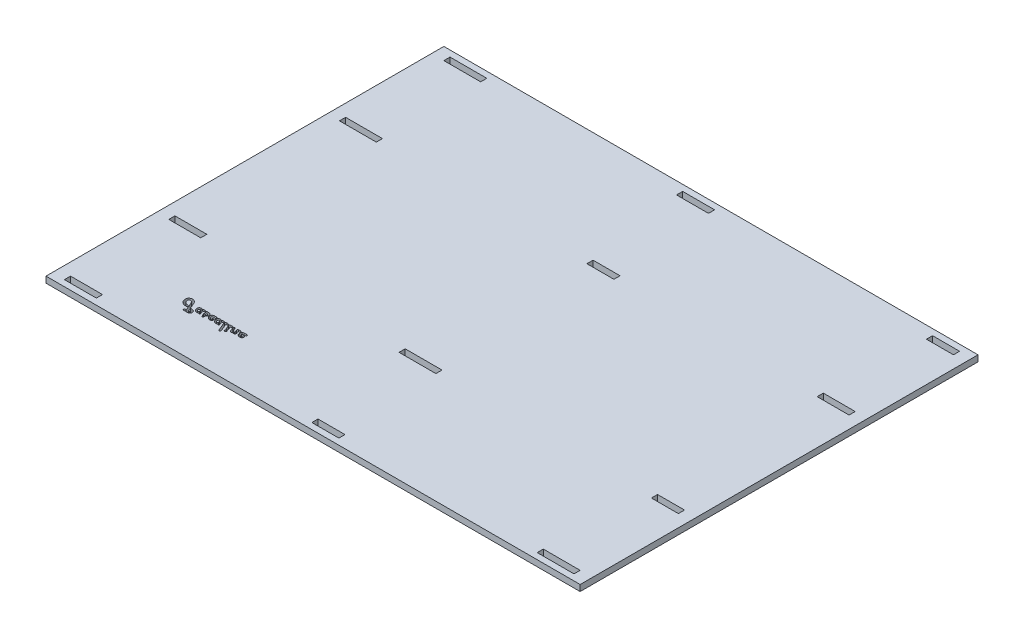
from build123d import *

# Parameters (mm, degrees)
SKETCH1_W           = 276.225
SKETCH1_H           = 205.74
SKETCH1_W_2         = 19.05
SKETCH1_H_2         = 3.175
SKETCH1_W_3         = 16.51
SKETCH1_W_4         = 13.97
BOSS_EXTRUDE1_DEPTH = 3.175
CUT_EXTRUDE1_DEPTH  = 345.440530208


with BuildPart() as part:
    # Sketch1 → Boss-Extrude1 (new body)
    with BuildSketch(Plane(origin=(0, 0, 0), x_dir=(1, 0, 0), z_dir=(0, 1, 0))):
        with Locations((138.1125, -102.87)):
            Rectangle(SKETCH1_W, SKETCH1_H)
        with Locations((15.875, -58.7375)):
            Rectangle(SKETCH1_W_2, SKETCH1_H_2, mode=Mode.SUBTRACT)
        with Locations((15.875, -4.7625)):
            Rectangle(SKETCH1_W_2, SKETCH1_H_2, mode=Mode.SUBTRACT)
        with Locations((134.9375, -4.7625)):
            Rectangle(SKETCH1_W_3, SKETCH1_H_2, mode=Mode.SUBTRACT)
        with Locations((262.89, -4.7625)):
            Rectangle(SKETCH1_W_4, SKETCH1_H_2, mode=Mode.SUBTRACT)
        with Locations((141.2875, -58.7375)):
            Rectangle(SKETCH1_W_4, SKETCH1_H_2, mode=Mode.SUBTRACT)
        with Locations((261.62, -58.7375)):
            Rectangle(SKETCH1_W_3, SKETCH1_H_2, mode=Mode.SUBTRACT)
        with Locations((14.605, -147.0025)):
            Rectangle(SKETCH1_W_3, SKETCH1_H_2, mode=Mode.SUBTRACT)
        with Locations((134.9375, -147.0025)):
            Rectangle(SKETCH1_W_2, SKETCH1_H_2, mode=Mode.SUBTRACT)
        with Locations((262.89, -147.0025)):
            Rectangle(SKETCH1_W_4, SKETCH1_H_2, mode=Mode.SUBTRACT)
        with Locations((14.605, -200.9775)):
            Rectangle(SKETCH1_W_3, SKETCH1_H_2, mode=Mode.SUBTRACT)
        with Locations((141.2875, -200.9775)):
            Rectangle(SKETCH1_W_4, SKETCH1_H_2, mode=Mode.SUBTRACT)
        with Locations((260.35, -200.9775)):
            Rectangle(SKETCH1_W_2, SKETCH1_H_2, mode=Mode.SUBTRACT)
    extrude(amount=BOSS_EXTRUDE1_DEPTH)

    # Sketch2 → Cut-Extrude1 (cut, through all)
    # profile 1 of 10: a face of its own
    with BuildSketch(Plane.XZ):
        with BuildLine():
            Line((51.708207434, 182.79452047), (51.040213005, 181.130477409))
            add(Edge.make_bspline(
                [(51.040213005, 181.130477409), (51.00001032, 181.031340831), (50.922835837, 180.841034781), (50.80844228, 180.568553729), (50.701686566, 180.320023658), (50.60179297, 180.095385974), (50.509724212, 179.893979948), (50.422539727, 179.717428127), (50.344969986, 179.563780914), (50.250360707, 179.39266641), (50.128120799, 179.202342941), (49.964033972, 178.99474829), (49.783466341, 178.802663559), (49.649135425, 178.689800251), (49.581798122, 178.633224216)],
                knots=[0, 0, 0, 0, 1.315970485, 2.526183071, 3.635244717, 4.643279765, 5.550454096, 6.359128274, 7.065363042, 7.667512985, 8.763908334, 9.843272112, 10.918877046, 12, 12, 12, 12], degree=3))
            add(Edge.make_bspline(
                [(49.581798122, 178.633224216), (49.530872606, 178.595142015), (49.430077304, 178.519767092), (49.269407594, 178.421962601), (49.103570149, 178.338383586), (48.930580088, 178.271585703), (48.752011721, 178.219327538), (48.567251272, 178.181172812), (48.376360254, 178.157947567), (48.24706303, 178.155470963), (48.181624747, 178.154217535)],
                knots=[0, 0, 0, 0, 1.011044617, 2.001129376, 2.987597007, 3.961339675, 4.946518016, 5.943976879, 6.959431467, 8, 8, 8, 8], degree=3))
            add(Edge.make_bspline(
                [(48.181624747, 178.154217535), (48.112991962, 178.155689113), (47.978819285, 178.158565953), (47.782876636, 178.18476624), (47.596129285, 178.223973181), (47.419787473, 178.283249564), (47.252340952, 178.356418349), (47.095607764, 178.447809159), (46.948674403, 178.554992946), (46.813814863, 178.678725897), (46.691575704, 178.814608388), (46.585375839, 178.961956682), (46.494000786, 179.118377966), (46.420454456, 179.285592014), (46.363061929, 179.462414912), (46.323373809, 179.648876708), (46.297313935, 179.84486499), (46.294417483, 179.979031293), (46.292935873, 180.047660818)],
                knots=[0, 0, 0, 0, 1.095039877, 2.140732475, 3.150521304, 4.13652018, 5.104897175, 6.062745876, 7.026672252, 8.00261995, 8.979018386, 9.939223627, 10.897072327, 11.865449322, 12.849478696, 13.859267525, 14.904960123, 16, 16, 16, 16], degree=3))
            add(Edge.make_bspline(
                [(46.292935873, 180.047660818), (46.295476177, 180.140106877), (46.300491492, 180.322622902), (46.339577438, 180.591864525), (46.403678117, 180.852395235), (46.494678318, 181.103879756), (46.610304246, 181.346741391), (46.753317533, 181.579480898), (46.921048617, 181.804170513), (47.049937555, 181.943030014), (47.115448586, 182.013608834)],
                knots=[0, 0, 0, 0, 1.01377589, 2.001495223, 2.977585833, 3.952291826, 4.930103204, 5.92294397, 6.944284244, 8, 8, 8, 8], degree=3))
            add(Edge.make_bspline(
                [(47.115448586, 182.013608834), (47.153044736, 182.050924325), (47.228930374, 182.126243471), (47.351390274, 182.231124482), (47.480395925, 182.331316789), (47.615349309, 182.426878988), (47.758843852, 182.513996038), (47.907546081, 182.598384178), (48.064614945, 182.674541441), (48.279714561, 182.771179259), (48.554431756, 182.870917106), (48.886845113, 182.958589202), (49.218755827, 183.011704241), (49.439773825, 183.019068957), (49.549705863, 183.02273209)],
                knots=[0, 0, 0, 0, 0.706155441, 1.425333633, 2.148189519, 2.883981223, 3.628821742, 4.385725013, 5.163077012, 5.955384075, 7.529784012, 9.053423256, 10.534403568, 12, 12, 12, 12], degree=3))
            add(Edge.make_bspline(
                [(49.549705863, 183.02273209), (49.59978406, 183.021540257), (49.695623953, 183.019259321), (49.831291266, 182.990920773), (49.952441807, 182.947665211), (50.056344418, 182.885588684), (50.141795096, 182.809995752), (50.205094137, 182.721046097), (50.242232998, 182.618989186), (50.246446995, 182.547193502), (50.248603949, 182.510444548)],
                knots=[0, 0, 0, 0, 1.238826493, 2.370872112, 3.417595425, 4.41258701, 5.350953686, 6.225146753, 7.091533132, 8, 8, 8, 8], degree=3))
            add(Edge.make_bspline(
                [(50.248603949, 182.510444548), (50.246165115, 182.47167473), (50.241410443, 182.396090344), (50.201524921, 182.288702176), (50.134061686, 182.194477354), (50.073237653, 182.145768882), (50.041787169, 182.120583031)],
                knots=[0, 0, 0, 0, 1.010937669, 1.970891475, 2.950802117, 4, 4, 4, 4], degree=3))
            add(Edge.make_bspline(
                [(50.041787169, 182.120583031), (50.017656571, 182.10617239), (49.963309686, 182.073716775), (49.860178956, 182.042998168), (49.731734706, 182.017208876), (49.636221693, 182.007184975), (49.584175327, 182.001722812)],
                knots=[0, 0, 0, 0, 0.704559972, 1.586808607, 2.68501851, 4, 4, 4, 4], degree=3))
            add(Edge.make_bspline(
                [(49.584175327, 182.001722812), (49.519905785, 181.995250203), (49.394570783, 181.982627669), (49.211967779, 181.953054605), (49.038200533, 181.919845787), (48.874225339, 181.876482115), (48.719190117, 181.827579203), (48.572698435, 181.774036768), (48.436580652, 181.710400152), (48.350934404, 181.662675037), (48.308805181, 181.639199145)],
                knots=[0, 0, 0, 0, 1.159710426, 2.261604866, 3.320677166, 4.335395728, 5.305245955, 6.239579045, 7.134052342, 8, 8, 8, 8], degree=3))
            add(Edge.make_bspline(
                [(48.308805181, 181.639199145), (48.243425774, 181.597250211), (48.114631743, 181.514612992), (47.943432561, 181.363133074), (47.79233938, 181.19487476), (47.664635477, 181.00902045), (47.562633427, 180.811182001), (47.487797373, 180.606164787), (47.441933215, 180.395180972), (47.43664309, 180.252322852), (47.433993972, 180.180784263)],
                knots=[0, 0, 0, 0, 1.047576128, 2.063670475, 3.075290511, 4.094745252, 5.099666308, 6.072755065, 7.034899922, 8, 8, 8, 8], degree=3))
            add(Edge.make_bspline(
                [(47.433993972, 180.180784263), (47.43464278, 180.145096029), (47.435914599, 180.075138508), (47.446906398, 179.973043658), (47.4640252, 179.87615749), (47.490795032, 179.785799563), (47.522869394, 179.700545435), (47.561701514, 179.620297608), (47.609924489, 179.546997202), (47.662983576, 179.478348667), (47.724139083, 179.418352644), (47.788911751, 179.364063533), (47.860332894, 179.320265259), (47.93554979, 179.282611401), (48.016358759, 179.25449148), (48.102029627, 179.234450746), (48.192262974, 179.220494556), (48.254470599, 179.219640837), (48.286221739, 179.219205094)],
                knots=[0, 0, 0, 0, 1.180906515, 2.314860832, 3.395146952, 4.432720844, 5.428859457, 6.408284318, 7.375873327, 8.328235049, 9.274073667, 10.205991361, 11.119268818, 12.040047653, 12.985704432, 13.943108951, 14.9501506, 16, 16, 16, 16], degree=3))
            add(Edge.make_bspline(
                [(48.286221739, 179.219205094), (48.326733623, 179.220089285), (48.406702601, 179.221834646), (48.523743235, 179.243468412), (48.636751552, 179.275266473), (48.745544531, 179.321036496), (48.85049787, 179.379435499), (48.950857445, 179.451340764), (49.046238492, 179.536749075), (49.139137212, 179.635601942), (49.229520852, 179.752163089), (49.324297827, 179.885231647), (49.418346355, 180.040578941), (49.515503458, 180.215206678), (49.615293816, 180.409494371), (49.717880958, 180.623606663), (49.820193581, 180.859081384), (49.888666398, 181.023020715), (49.924115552, 181.107893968)],
                knots=[0, 0, 0, 0, 0.731682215, 1.444313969, 2.14503258, 2.851587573, 3.573238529, 4.31284086, 5.079201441, 5.885132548, 6.76239785, 7.744387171, 8.838039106, 10.04403949, 11.357848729, 12.787140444, 14.336666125, 16, 16, 16, 16], degree=3))
            Line((49.924115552, 181.107893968), (51.319534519, 184.544142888))
            Line((51.319534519, 184.544142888), (50.882128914, 184.544142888))
            add(Edge.make_bspline(
                [(50.882128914, 184.544142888), (50.838488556, 184.54522865), (50.756791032, 184.547261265), (50.642475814, 184.563396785), (50.544918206, 184.590948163), (50.464559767, 184.631358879), (50.401089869, 184.683751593), (50.355558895, 184.748821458), (50.32861426, 184.826228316), (50.326022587, 184.881488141), (50.324674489, 184.910232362)],
                knots=[0, 0, 0, 0, 1.386647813, 2.595892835, 3.659749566, 4.594681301, 5.434731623, 6.248703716, 7.089037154, 8, 8, 8, 8], degree=3))
            add(Edge.make_bspline(
                [(50.324674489, 184.910232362), (50.326610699, 184.951372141), (50.330345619, 185.030730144), (50.369106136, 185.142032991), (50.430929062, 185.23923404), (50.519700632, 185.318386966), (50.629358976, 185.381488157), (50.759608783, 185.426231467), (50.909273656, 185.451690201), (51.015149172, 185.455156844), (51.071116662, 185.456989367)],
                knots=[0, 0, 0, 0, 0.942601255, 1.818263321, 2.674766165, 3.564433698, 4.523656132, 5.566505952, 6.713616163, 8, 8, 8, 8], degree=3))
            Line((51.071116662, 185.456989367), (52.598470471, 185.456989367))
            add(Edge.make_bspline(
                [(52.598470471, 185.456989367), (52.661491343, 185.45605179), (52.783711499, 185.454233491), (52.960666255, 185.440997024), (53.125164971, 185.420336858), (53.276667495, 185.389726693), (53.415010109, 185.349404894), (53.540711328, 185.300515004), (53.65455597, 185.244026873), (53.755463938, 185.176779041), (53.843887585, 185.100669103), (53.920324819, 185.014744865), (53.983980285, 184.919078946), (54.038875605, 184.814945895), (54.07866019, 184.699753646), (54.106672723, 184.575328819), (54.12514973, 184.441676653), (54.127163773, 184.349276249), (54.128201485, 184.301668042)],
                knots=[0, 0, 0, 0, 1.377685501, 2.671828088, 3.877302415, 5.000186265, 6.047243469, 7.023626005, 7.94558449, 8.820055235, 9.667510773, 10.489711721, 11.325757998, 12.174186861, 13.056345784, 13.980864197, 14.959664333, 16, 16, 16, 16], degree=3))
            add(Edge.make_bspline(
                [(54.128201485, 184.301668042), (54.126224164, 184.24294268), (54.122343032, 184.127675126), (54.09622563, 183.958719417), (54.050564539, 183.798497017), (53.987547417, 183.64601214), (53.904433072, 183.503066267), (53.804741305, 183.367351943), (53.687249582, 183.239446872), (53.596640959, 183.164349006), (53.550540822, 183.12614048)],
                knots=[0, 0, 0, 0, 1.037190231, 2.03582197, 3.010506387, 3.973515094, 4.942177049, 5.923321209, 6.943420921, 8, 8, 8, 8], degree=3))
            add(Edge.make_bspline(
                [(53.550540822, 183.12614048), (53.513867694, 183.099501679), (53.438573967, 183.044809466), (53.311285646, 182.977706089), (53.170301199, 182.920538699), (53.014829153, 182.874856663), (52.846058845, 182.838032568), (52.662920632, 182.812269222), (52.465619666, 182.796761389), (52.329083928, 182.795283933), (52.258530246, 182.79452047)],
                knots=[0, 0, 0, 0, 0.800437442, 1.643380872, 2.535600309, 3.486195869, 4.50417187, 5.586788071, 6.752993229, 8, 8, 8, 8], degree=3))
            Line((52.258530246, 182.79452047), (51.708207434, 182.79452047))
        make_face()
        with BuildLine():
            Line((52.098068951, 183.707366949), (52.422557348, 183.707366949))
            add(Edge.make_bspline(
                [(52.422557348, 183.707366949), (52.47258784, 183.708782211), (52.5670161, 183.711453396), (52.698819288, 183.735741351), (52.811272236, 183.777278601), (52.904227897, 183.83600151), (52.977428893, 183.91333287), (53.026980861, 184.00899527), (53.059364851, 184.119724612), (53.061886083, 184.199195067), (53.063213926, 184.241049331)],
                knots=[0, 0, 0, 0, 1.258971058, 2.376199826, 3.358208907, 4.260347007, 5.121448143, 6.005251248, 6.949436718, 8, 8, 8, 8], degree=3))
            add(Edge.make_bspline(
                [(53.063213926, 184.241049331), (53.062073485, 184.264903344), (53.059913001, 184.310093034), (53.043862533, 184.373529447), (53.013918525, 184.426356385), (52.973772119, 184.471207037), (52.920096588, 184.503760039), (52.856537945, 184.527978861), (52.781703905, 184.541857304), (52.728086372, 184.543348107), (52.699501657, 184.544142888)],
                knots=[0, 0, 0, 0, 1.057975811, 2.004258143, 2.869579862, 3.727735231, 4.644179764, 5.623179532, 6.73286349, 8, 8, 8, 8], degree=3))
            Line((52.699501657, 184.544142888), (52.430877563, 184.544142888))
            Line((52.430877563, 184.544142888), (52.098068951, 183.707366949))
        make_face(mode=Mode.SUBTRACT)
    # profile 2 of 10: a face of its own
    with BuildSketch(Plane.XZ):
        with BuildLine():
            Line((56.179728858, 180.892756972), (56.621888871, 180.892756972))
            add(Edge.make_bspline(
                [(56.621888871, 180.892756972), (56.65877742, 180.891594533), (56.728224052, 180.889406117), (56.826106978, 180.873955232), (56.908503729, 180.843823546), (56.978460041, 180.805117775), (57.030736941, 180.750669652), (57.06864948, 180.685580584), (57.091822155, 180.608611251), (57.093872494, 180.553382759), (57.094952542, 180.524290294)],
                knots=[0, 0, 0, 0, 1.294214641, 2.436497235, 3.45633191, 4.35958604, 5.214514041, 6.067746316, 6.982155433, 8, 8, 8, 8], degree=3))
            add(Edge.make_bspline(
                [(57.094952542, 180.524290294), (57.093081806, 180.483662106), (57.089494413, 180.405751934), (57.056928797, 180.295389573), (57.000244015, 180.200597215), (56.924490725, 180.119531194), (56.828856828, 180.056616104), (56.716859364, 180.010515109), (56.588114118, 179.985437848), (56.497188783, 179.981811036), (56.449541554, 179.979910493)],
                knots=[0, 0, 0, 0, 1.02006706, 1.956119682, 2.85821293, 3.77438774, 4.72208319, 5.713685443, 6.801912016, 8, 8, 8, 8], degree=3))
            Line((56.449541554, 179.979910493), (55.93606541, 179.979910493))
            add(Edge.make_bspline(
                [(55.93606541, 179.979910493), (55.908278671, 179.980834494), (55.855146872, 179.982601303), (55.778668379, 179.995720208), (55.708938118, 180.018400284), (55.64573203, 180.050207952), (55.590092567, 180.09183418), (55.540574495, 180.140920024), (55.498327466, 180.199999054), (55.477364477, 180.244587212), (55.466567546, 180.267552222)],
                knots=[0, 0, 0, 0, 1.135602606, 2.17141737, 3.159933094, 4.123316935, 5.049777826, 5.988893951, 6.964185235, 8, 8, 8, 8], degree=3))
            add(Edge.make_bspline(
                [(55.466567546, 180.267552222), (55.418424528, 180.223702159), (55.327712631, 180.141079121), (55.178084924, 180.051827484), (55.031771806, 179.990628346), (54.932230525, 179.983401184), (54.884152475, 179.979910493)],
                knots=[0, 0, 0, 0, 1.172355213, 2.208971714, 3.134940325, 4, 4, 4, 4], degree=3))
            Line((54.884152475, 179.979910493), (54.427729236, 179.979910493))
            add(Edge.make_bspline(
                [(54.427729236, 179.979910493), (54.391619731, 179.98075717), (54.321087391, 179.982410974), (54.21802747, 179.997305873), (54.12000323, 180.02024658), (54.028140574, 180.055821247), (53.940772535, 180.098131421), (53.858897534, 180.15116498), (53.783351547, 180.214399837), (53.712720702, 180.285630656), (53.650399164, 180.365631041), (53.593831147, 180.450840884), (53.54763786, 180.543303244), (53.509384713, 180.641169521), (53.480024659, 180.744712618), (53.458019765, 180.853918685), (53.446842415, 180.969387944), (53.444675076, 181.048444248), (53.443566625, 181.088876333)],
                knots=[0, 0, 0, 0, 1.038881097, 2.029236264, 2.991883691, 3.930308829, 4.858629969, 5.782385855, 6.730121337, 7.689859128, 8.664191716, 9.644845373, 10.629272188, 11.633194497, 12.665607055, 13.723595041, 14.835769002, 16, 16, 16, 16], degree=3))
            add(Edge.make_bspline(
                [(53.443566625, 181.088876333), (53.445107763, 181.15077263), (53.448153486, 181.27309718), (53.474253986, 181.454146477), (53.515431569, 181.630157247), (53.574158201, 181.801314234), (53.649827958, 181.966769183), (53.739823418, 182.128417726), (53.849725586, 182.283187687), (53.972472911, 182.432189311), (54.106072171, 182.569321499), (54.245351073, 182.690858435), (54.390556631, 182.79213683), (54.538505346, 182.87771364), (54.692535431, 182.942119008), (54.850193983, 182.989085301), (55.01272361, 183.016977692), (55.1225611, 183.020807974), (55.177737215, 183.02273209)],
                knots=[0, 0, 0, 0, 1.038393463, 2.052158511, 3.063456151, 4.068635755, 5.08344709, 6.113632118, 7.168837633, 8.264602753, 9.350863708, 10.378663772, 11.361961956, 12.31789787, 13.241700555, 14.156967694, 15.07416527, 16, 16, 16, 16], degree=3))
            add(Edge.make_bspline(
                [(55.177737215, 183.02273209), (55.21896168, 183.021712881), (55.298853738, 183.019737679), (55.414942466, 183.007573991), (55.521853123, 182.982630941), (55.621654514, 182.953341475), (55.711262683, 182.910617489), (55.793015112, 182.860644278), (55.866700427, 182.801379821), (55.907423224, 182.753986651), (55.927745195, 182.730335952)],
                knots=[0, 0, 0, 0, 1.187749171, 2.30183041, 3.353985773, 4.346587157, 5.291117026, 6.203238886, 7.103359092, 8, 8, 8, 8], degree=3))
            add(Edge.make_bspline(
                [(55.927745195, 182.730335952), (55.944680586, 182.753711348), (55.977579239, 182.799120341), (56.033899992, 182.858946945), (56.094136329, 182.909541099), (56.15789977, 182.951846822), (56.227160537, 182.982068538), (56.298281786, 183.007094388), (56.374614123, 183.019744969), (56.426524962, 183.021720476), (56.453107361, 183.02273209)],
                knots=[0, 0, 0, 0, 1.102961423, 2.142610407, 3.131917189, 4.106850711, 5.056016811, 6.014208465, 6.983119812, 8, 8, 8, 8], degree=3))
            add(Edge.make_bspline(
                [(56.453107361, 183.02273209), (56.481339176, 183.021284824), (56.536574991, 183.018453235), (56.615795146, 182.99865781), (56.686667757, 182.962530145), (56.748918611, 182.915388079), (56.801997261, 182.859045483), (56.839082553, 182.793239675), (56.863372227, 182.721313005), (56.865598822, 182.670711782), (56.866740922, 182.644756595)],
                knots=[0, 0, 0, 0, 1.085152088, 2.123110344, 3.11068521, 4.121931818, 5.11360817, 6.061884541, 7.005870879, 8, 8, 8, 8], degree=3))
            add(Edge.make_bspline(
                [(56.866740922, 182.644756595), (56.866045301, 182.625686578), (56.864569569, 182.585230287), (56.851696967, 182.522308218), (56.831502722, 182.454251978), (56.812512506, 182.40846021), (56.802556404, 182.384452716)],
                knots=[0, 0, 0, 0, 0.847236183, 1.797378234, 2.845219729, 4, 4, 4, 4], degree=3))
            Line((56.802556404, 182.384452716), (56.758578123, 182.278667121))
            Line((56.758578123, 182.278667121), (56.179728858, 180.892756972))
        make_face()
        with BuildLine():
            Line((54.72369118, 180.892756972), (54.824722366, 180.892756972))
            add(Edge.make_bspline(
                [(54.824722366, 180.892756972), (54.850124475, 180.893313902), (54.899252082, 180.894391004), (54.969711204, 180.906223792), (55.03322592, 180.926536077), (55.090449, 180.954060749), (55.140540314, 180.989991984), (55.184311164, 181.033437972), (55.22046545, 181.085632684), (55.238538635, 181.124621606), (55.247864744, 181.144740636)],
                knots=[0, 0, 0, 0, 1.157664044, 2.238919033, 3.244614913, 4.190073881, 5.122668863, 6.042574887, 6.989931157, 8, 8, 8, 8], degree=3))
            Line((55.247864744, 181.144740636), (55.518866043, 181.796094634))
            add(Edge.make_bspline(
                [(55.518866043, 181.796094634), (55.535057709, 181.834756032), (55.563854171, 181.903514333), (55.570592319, 181.977609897), (55.573541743, 182.010043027)],
                knots=[0, 0, 0, 0, 1.124559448, 2, 2, 2, 2], degree=3))
            add(Edge.make_bspline(
                [(55.573541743, 182.010043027), (55.571926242, 182.026420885), (55.568667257, 182.059460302), (55.549280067, 182.107946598), (55.512147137, 182.149283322), (55.466474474, 182.188201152), (55.41115605, 182.221159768), (55.348788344, 182.244753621), (55.28104204, 182.2595835), (55.234077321, 182.261194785), (55.209829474, 182.262026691)],
                knots=[0, 0, 0, 0, 0.81058345, 1.635208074, 2.524363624, 3.523748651, 4.593951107, 5.683817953, 6.804157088, 8, 8, 8, 8], degree=3))
            add(Edge.make_bspline(
                [(55.209829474, 182.262026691), (55.185181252, 182.261194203), (55.13540106, 182.25951289), (55.061578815, 182.243028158), (54.988551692, 182.218040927), (54.916085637, 182.182654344), (54.844138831, 182.137487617), (54.772190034, 182.082509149), (54.702427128, 182.016225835), (54.610883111, 181.918994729), (54.512009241, 181.78794112), (54.42333729, 181.622275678), (54.367109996, 181.452594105), (54.359954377, 181.337299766), (54.356413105, 181.280241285)],
                knots=[0, 0, 0, 0, 0.627706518, 1.267732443, 1.919531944, 2.592823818, 3.31892668, 4.082778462, 4.897707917, 5.769757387, 7.487317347, 9.064628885, 10.547302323, 12, 12, 12, 12], degree=3))
            add(Edge.make_bspline(
                [(54.356413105, 181.280241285), (54.357553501, 181.250053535), (54.359718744, 181.192736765), (54.375717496, 181.1124477), (54.403996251, 181.043784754), (54.446132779, 180.988202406), (54.499537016, 180.944732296), (54.564430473, 180.913075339), (54.640792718, 180.895788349), (54.695078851, 180.893803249), (54.72369118, 180.892756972)],
                knots=[0, 0, 0, 0, 1.183693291, 2.247450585, 3.194323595, 4.070859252, 4.954393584, 5.871857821, 6.878330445, 8, 8, 8, 8], degree=3))
        make_face(mode=Mode.SUBTRACT)
    # profile 3 of 10: a face of its own
    with BuildSketch(Plane.XZ):
        with BuildLine():
            Line((58.579516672, 181.960121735), (58.501068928, 181.790151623))
            add(Edge.make_bspline(
                [(58.501068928, 181.790151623), (58.485890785, 181.761223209), (58.456702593, 181.705592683), (58.403550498, 181.631320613), (58.346822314, 181.56745055), (58.284053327, 181.515760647), (58.217135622, 181.474518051), (58.144776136, 181.445719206), (58.067612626, 181.428787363), (58.014618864, 181.426445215), (57.987592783, 181.425250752)],
                knots=[0, 0, 0, 0, 1.174117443, 2.257875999, 3.277186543, 4.239058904, 5.172954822, 6.09414408, 7.028039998, 8, 8, 8, 8], degree=3))
            add(Edge.make_bspline(
                [(57.987592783, 181.425250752), (57.960140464, 181.426706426), (57.90567426, 181.429594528), (57.826103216, 181.450224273), (57.751642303, 181.485549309), (57.683627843, 181.532339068), (57.626114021, 181.588014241), (57.582795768, 181.649788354), (57.556181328, 181.716793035), (57.552973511, 181.763381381), (57.551375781, 181.786585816)],
                knots=[0, 0, 0, 0, 1.057292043, 2.097698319, 3.142574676, 4.21811325, 5.26521749, 6.20945791, 7.108177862, 8, 8, 8, 8], degree=3))
            add(Edge.make_bspline(
                [(57.551375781, 181.786585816), (57.552908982, 181.810895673), (57.556280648, 181.864355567), (57.581796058, 181.948344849), (57.616806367, 182.044307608), (57.650035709, 182.109427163), (57.667858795, 182.144355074)],
                knots=[0, 0, 0, 0, 0.768398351, 1.68978755, 2.760880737, 4, 4, 4, 4], degree=3))
            Line((57.667858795, 182.144355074), (58.201541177, 183.182004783))
            add(Edge.make_bspline(
                [(58.201541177, 183.182004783), (58.218004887, 183.211670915), (58.2493616, 183.268172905), (58.303614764, 183.34426393), (58.360852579, 183.408508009), (58.419819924, 183.463301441), (58.483704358, 183.504104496), (58.550329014, 183.533051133), (58.619695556, 183.551884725), (58.66735573, 183.554110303), (58.691245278, 183.555225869)],
                knots=[0, 0, 0, 0, 1.254889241, 2.390056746, 3.44940031, 4.435704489, 5.358962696, 6.23882182, 7.117213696, 8, 8, 8, 8], degree=3))
            add(Edge.make_bspline(
                [(58.691245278, 183.555225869), (58.7167303, 183.554244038), (58.766483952, 183.552327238), (58.838034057, 183.532558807), (58.903259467, 183.499927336), (58.960656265, 183.455530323), (59.011356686, 183.405018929), (59.045588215, 183.345159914), (59.069145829, 183.28158863), (59.071556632, 183.23689759), (59.072786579, 183.214097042)],
                knots=[0, 0, 0, 0, 1.076175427, 2.100985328, 3.113101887, 4.142426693, 5.162150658, 6.116677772, 7.039163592, 8, 8, 8, 8], degree=3))
            add(Edge.make_bspline(
                [(59.072786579, 183.214097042), (59.072196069, 183.206535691), (59.07071348, 183.187551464), (59.061114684, 183.154321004), (59.046930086, 183.110327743), (59.034533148, 183.077747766), (59.027619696, 183.059578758)],
                knots=[0, 0, 0, 0, 0.562304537, 1.411773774, 2.556613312, 4, 4, 4, 4], degree=3))
            add(Edge.make_bspline(
                [(59.027619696, 183.059578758), (59.018940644, 183.032065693), (59.002914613, 182.981262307), (58.998664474, 182.928198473), (58.99671604, 182.903871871)],
                knots=[0, 0, 0, 0, 1.083119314, 2, 2, 2, 2], degree=3))
            add(Edge.make_bspline(
                [(58.99671604, 182.903871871), (58.999367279, 182.861582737), (59.004773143, 182.775355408), (59.046413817, 182.64653534), (59.110348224, 182.516045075), (59.170789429, 182.435055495), (59.202344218, 182.392772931)],
                knots=[0, 0, 0, 0, 0.903479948, 1.84219102, 2.873463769, 4, 4, 4, 4], degree=3))
            Line((59.202344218, 182.392772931), (59.451950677, 182.078981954))
            add(Edge.make_bspline(
                [(59.451950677, 182.078981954), (59.482165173, 182.039323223), (59.540824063, 181.962329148), (59.618523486, 181.84355279), (59.68564551, 181.726600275), (59.739211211, 181.609464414), (59.781589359, 181.493521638), (59.811006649, 181.378436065), (59.830062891, 181.264233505), (59.832353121, 181.188395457), (59.833491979, 181.150683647)],
                knots=[0, 0, 0, 0, 1.169686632, 2.270847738, 3.328397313, 4.331060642, 5.289870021, 6.221237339, 7.115478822, 8, 8, 8, 8], degree=3))
            add(Edge.make_bspline(
                [(59.833491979, 181.150683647), (59.832381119, 181.109809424), (59.830191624, 181.029246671), (59.811960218, 180.911259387), (59.78216535, 180.79845238), (59.740229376, 180.690841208), (59.686717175, 180.58819061), (59.620463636, 180.491251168), (59.542696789, 180.399354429), (59.454177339, 180.313590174), (59.357201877, 180.234785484), (59.252009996, 180.167811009), (59.142713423, 180.108252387), (59.026158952, 180.062572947), (58.904727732, 180.025019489), (58.777209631, 179.99984317), (58.644216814, 179.981754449), (58.553432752, 179.980534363), (58.507011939, 179.979910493)],
                knots=[0, 0, 0, 0, 0.993241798, 1.957671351, 2.894532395, 3.824635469, 4.759513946, 5.702543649, 6.673110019, 7.681185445, 8.695042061, 9.70491044, 10.708882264, 11.715852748, 12.742665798, 13.794825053, 14.872423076, 16, 16, 16, 16], degree=3))
            Line((58.507011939, 179.979910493), (57.669047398, 179.979910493))
            add(Edge.make_bspline(
                [(57.669047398, 179.979910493), (57.630173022, 179.981059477), (57.55717118, 179.983217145), (57.454673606, 179.998710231), (57.367856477, 180.028517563), (57.295727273, 180.068926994), (57.238693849, 180.12138835), (57.198145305, 180.186520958), (57.175736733, 180.26416277), (57.172649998, 180.319310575), (57.171023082, 180.348377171)],
                knots=[0, 0, 0, 0, 1.323532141, 2.485449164, 3.513452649, 4.431917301, 5.281225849, 6.123328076, 7.010867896, 8, 8, 8, 8], degree=3))
            add(Edge.make_bspline(
                [(57.171023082, 180.348377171), (57.172772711, 180.389042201), (57.176132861, 180.46713907), (57.210450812, 180.577312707), (57.267783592, 180.672470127), (57.347036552, 180.752372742), (57.446102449, 180.814960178), (57.561710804, 180.862237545), (57.694943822, 180.887233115), (57.788605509, 180.890854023), (57.837828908, 180.892756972)],
                knots=[0, 0, 0, 0, 1.001377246, 1.923137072, 2.813709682, 3.719614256, 4.674449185, 5.687788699, 6.784829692, 8, 8, 8, 8], degree=3))
            Line((57.837828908, 180.892756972), (58.302572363, 180.892756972))
            add(Edge.make_bspline(
                [(58.302572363, 180.892756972), (58.350983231, 180.893625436), (58.44189679, 180.895256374), (58.5684666, 180.914077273), (58.676175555, 180.944192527), (58.765109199, 180.986785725), (58.835919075, 181.042415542), (58.88631187, 181.11227934), (58.915997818, 181.195600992), (58.919047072, 181.255030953), (58.9206455, 181.286184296)],
                knots=[0, 0, 0, 0, 1.402558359, 2.633945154, 3.698995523, 4.63394819, 5.475307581, 6.281836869, 7.099334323, 8, 8, 8, 8], degree=3))
            add(Edge.make_bspline(
                [(58.9206455, 181.286184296), (58.918766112, 181.311301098), (58.914756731, 181.36488389), (58.888824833, 181.447162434), (58.849516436, 181.536033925), (58.812917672, 181.594082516), (58.793465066, 181.624935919)],
                knots=[0, 0, 0, 0, 0.822745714, 1.755200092, 2.806866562, 4, 4, 4, 4], degree=3))
            Line((58.793465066, 181.624935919), (58.579516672, 181.960121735))
        make_face()
    # profile 4 of 10: a face of its own
    with BuildSketch(Plane.XZ):
        with BuildLine():
            Line((62.43296496, 179.979910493), (61.26932342, 179.979910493))
            add(Edge.make_bspline(
                [(61.26932342, 179.979910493), (61.228479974, 179.981241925), (61.148481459, 179.983849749), (61.0311285, 179.998716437), (60.920096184, 180.0271595), (60.813683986, 180.062769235), (60.714235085, 180.112887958), (60.620441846, 180.171915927), (60.532351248, 180.242045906), (60.451155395, 180.322207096), (60.377910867, 180.411284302), (60.312648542, 180.506584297), (60.259877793, 180.60986109), (60.213990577, 180.717896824), (60.179254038, 180.833058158), (60.156637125, 180.954691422), (60.139921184, 181.082080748), (60.138499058, 181.169247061), (60.137774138, 181.213679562)],
                knots=[0, 0, 0, 0, 1.04308008, 2.043041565, 3.012085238, 3.965374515, 4.901770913, 5.84746328, 6.790555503, 7.770466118, 8.754752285, 9.731054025, 10.712842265, 11.710345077, 12.724731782, 13.776116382, 14.86638876, 16, 16, 16, 16], degree=3))
            add(Edge.make_bspline(
                [(60.137774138, 181.213679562), (60.139440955, 181.273580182), (60.142732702, 181.391876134), (60.16686187, 181.566355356), (60.207622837, 181.735091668), (60.264052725, 181.898009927), (60.339417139, 182.053684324), (60.428368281, 182.204302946), (60.535146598, 182.348058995), (60.654978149, 182.485099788), (60.787342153, 182.609645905), (60.925831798, 182.720828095), (61.070903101, 182.814219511), (61.221083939, 182.891287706), (61.378237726, 182.949159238), (61.540356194, 182.992726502), (61.708709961, 183.017941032), (61.822734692, 183.021125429), (61.880264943, 183.02273209)],
                knots=[0, 0, 0, 0, 1.033018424, 2.040077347, 3.031267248, 4.023304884, 5.007568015, 6.009629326, 7.036117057, 8.091719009, 9.145549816, 10.16692925, 11.15074152, 12.116516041, 13.072326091, 14.033738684, 15.007938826, 16, 16, 16, 16], degree=3))
            add(Edge.make_bspline(
                [(61.880264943, 183.02273209), (61.919129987, 183.022201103), (61.995072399, 183.021163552), (62.105841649, 183.008592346), (62.211349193, 182.990134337), (62.310990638, 182.96247458), (62.405690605, 182.928486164), (62.493925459, 182.884844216), (62.577759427, 182.835376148), (62.654541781, 182.776951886), (62.724221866, 182.713346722), (62.786070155, 182.645128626), (62.837361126, 182.571064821), (62.878544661, 182.492054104), (62.913350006, 182.409440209), (62.934532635, 182.321066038), (62.95001719, 182.228494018), (62.951581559, 182.165028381), (62.952384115, 182.132469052)],
                knots=[0, 0, 0, 0, 1.192851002, 2.330834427, 3.419016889, 4.478598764, 5.502444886, 6.503631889, 7.49680333, 8.487139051, 9.460210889, 10.390750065, 11.308717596, 12.217610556, 13.123567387, 14.053072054, 15.001181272, 16, 16, 16, 16], degree=3))
            add(Edge.make_bspline(
                [(62.952384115, 182.132469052), (62.950790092, 182.088294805), (62.947723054, 182.003299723), (62.917648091, 181.882188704), (62.872129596, 181.771886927), (62.805017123, 181.677194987), (62.72429999, 181.598943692), (62.630836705, 181.541521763), (62.525687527, 181.506671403), (62.451853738, 181.503136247), (62.413947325, 181.501321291)],
                knots=[0, 0, 0, 0, 1.140049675, 2.193554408, 3.207776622, 4.208142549, 5.171800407, 6.095933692, 7.022448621, 8, 8, 8, 8], degree=3))
            add(Edge.make_bspline(
                [(62.413947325, 181.501321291), (62.384548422, 181.502065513), (62.32931807, 181.503463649), (62.252574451, 181.517996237), (62.186722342, 181.539705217), (62.132784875, 181.572701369), (62.089425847, 181.614701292), (62.060826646, 181.668417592), (62.042427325, 181.729915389), (62.040529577, 181.774157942), (62.039537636, 181.797283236)],
                knots=[0, 0, 0, 0, 1.293872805, 2.430738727, 3.43019671, 4.33150824, 5.195698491, 6.055468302, 6.983605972, 8, 8, 8, 8], degree=3))
            add(Edge.make_bspline(
                [(62.039537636, 181.797283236), (62.039537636, 181.811150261), (62.039537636, 181.836507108), (62.039537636, 181.861863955), (62.039537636, 181.873353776)],
                knots=[0, 0, 0, 0, 1.09375, 2, 2, 2, 2], degree=3))
            add(Edge.make_bspline(
                [(62.039537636, 181.873353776), (62.039537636, 181.885635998), (62.039537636, 181.909408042), (62.039537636, 181.933180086), (62.039537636, 181.944669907)],
                knots=[0, 0, 0, 0, 1.033333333, 2, 2, 2, 2], degree=3))
            add(Edge.make_bspline(
                [(62.039537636, 181.944669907), (62.038685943, 181.963786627), (62.037083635, 181.999751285), (62.023620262, 182.049827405), (62.002517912, 182.092997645), (61.969920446, 182.127461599), (61.928484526, 182.153648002), (61.878760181, 182.17243143), (61.820624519, 182.184660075), (61.778907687, 182.185505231), (61.756650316, 182.185956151)],
                knots=[0, 0, 0, 0, 1.076936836, 2.026062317, 2.906040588, 3.760364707, 4.665822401, 5.649858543, 6.746118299, 8, 8, 8, 8], degree=3))
            add(Edge.make_bspline(
                [(61.756650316, 182.185956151), (61.712627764, 182.183073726), (61.623948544, 182.177267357), (61.495684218, 182.12582123), (61.375491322, 182.043681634), (61.265562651, 181.934796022), (61.172041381, 181.807609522), (61.100898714, 181.669296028), (61.059284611, 181.521520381), (61.053523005, 181.420350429), (61.050620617, 181.369386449)],
                knots=[0, 0, 0, 0, 0.889989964, 1.79279967, 2.759962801, 3.828151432, 4.914528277, 5.949409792, 6.967022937, 8, 8, 8, 8], degree=3))
            add(Edge.make_bspline(
                [(61.050620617, 181.369386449), (61.052862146, 181.329158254), (61.05710115, 181.253081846), (61.089739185, 181.146959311), (61.149788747, 181.061566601), (61.232816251, 180.993889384), (61.344278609, 180.946988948), (61.48376126, 180.915809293), (61.653497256, 180.896235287), (61.776796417, 180.89397712), (61.843418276, 180.892756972)],
                knots=[0, 0, 0, 0, 0.913027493, 1.726645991, 2.482782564, 3.249916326, 4.127695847, 5.201188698, 6.487726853, 8, 8, 8, 8], degree=3))
            Line((61.843418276, 180.892756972), (62.60174647, 180.892756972))
            add(Edge.make_bspline(
                [(62.60174647, 180.892756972), (62.641060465, 180.891816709), (62.714997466, 180.890048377), (62.818060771, 180.871956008), (62.906397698, 180.844728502), (62.979477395, 180.803383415), (63.036571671, 180.7492406), (63.07715167, 180.682839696), (63.099972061, 180.604575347), (63.102947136, 180.549009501), (63.104525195, 180.519535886)],
                knots=[0, 0, 0, 0, 1.322009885, 2.486276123, 3.511116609, 4.419281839, 5.287086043, 6.131096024, 7.008683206, 8, 8, 8, 8], degree=3))
            add(Edge.make_bspline(
                [(63.104525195, 180.519535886), (63.102873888, 180.47962238), (63.099683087, 180.402498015), (63.063592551, 180.294327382), (63.005993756, 180.199146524), (62.925234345, 180.119497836), (62.825201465, 180.056518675), (62.708797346, 180.010756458), (62.575890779, 179.985331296), (62.482202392, 179.98177794), (62.43296496, 179.979910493)],
                knots=[0, 0, 0, 0, 0.982987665, 1.899414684, 2.782606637, 3.710260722, 4.674394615, 5.685217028, 6.783478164, 8, 8, 8, 8], degree=3))
        make_face()
    # profile 5 of 10: a face of its own
    with BuildSketch(Plane.XZ):
        with BuildLine():
            Line((65.992828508, 180.892756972), (66.434988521, 180.892756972))
            add(Edge.make_bspline(
                [(66.434988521, 180.892756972), (66.47187707, 180.891594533), (66.541323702, 180.889406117), (66.639206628, 180.873955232), (66.721603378, 180.843823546), (66.79155969, 180.805117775), (66.84383659, 180.750669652), (66.88174913, 180.685580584), (66.904921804, 180.608611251), (66.906972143, 180.553382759), (66.908052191, 180.524290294)],
                knots=[0, 0, 0, 0, 1.294214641, 2.436497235, 3.45633191, 4.35958604, 5.214514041, 6.067746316, 6.982155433, 8, 8, 8, 8], degree=3))
            add(Edge.make_bspline(
                [(66.908052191, 180.524290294), (66.906181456, 180.483662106), (66.902594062, 180.405751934), (66.870028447, 180.295389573), (66.813343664, 180.200597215), (66.737590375, 180.119531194), (66.641956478, 180.056616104), (66.529959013, 180.010515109), (66.401213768, 179.985437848), (66.310288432, 179.981811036), (66.262641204, 179.979910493)],
                knots=[0, 0, 0, 0, 1.02006706, 1.956119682, 2.85821293, 3.77438774, 4.72208319, 5.713685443, 6.801912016, 8, 8, 8, 8], degree=3))
            Line((66.262641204, 179.979910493), (65.74916506, 179.979910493))
            add(Edge.make_bspline(
                [(65.74916506, 179.979910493), (65.72137832, 179.980834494), (65.668246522, 179.982601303), (65.591768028, 179.995720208), (65.522037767, 180.018400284), (65.45883168, 180.050207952), (65.403192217, 180.09183418), (65.353674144, 180.140920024), (65.311427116, 180.199999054), (65.290464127, 180.244587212), (65.279667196, 180.267552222)],
                knots=[0, 0, 0, 0, 1.135602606, 2.17141737, 3.159933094, 4.123316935, 5.049777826, 5.988893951, 6.964185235, 8, 8, 8, 8], degree=3))
            add(Edge.make_bspline(
                [(65.279667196, 180.267552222), (65.231524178, 180.223702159), (65.140812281, 180.141079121), (64.991184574, 180.051827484), (64.844871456, 179.990628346), (64.745330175, 179.983401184), (64.697252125, 179.979910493)],
                knots=[0, 0, 0, 0, 1.172355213, 2.208971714, 3.134940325, 4, 4, 4, 4], degree=3))
            Line((64.697252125, 179.979910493), (64.240828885, 179.979910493))
            add(Edge.make_bspline(
                [(64.240828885, 179.979910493), (64.204719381, 179.98075717), (64.13418704, 179.982410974), (64.03112712, 179.997305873), (63.93310288, 180.02024658), (63.841240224, 180.055821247), (63.753872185, 180.098131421), (63.671997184, 180.15116498), (63.596451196, 180.214399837), (63.525820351, 180.285630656), (63.463498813, 180.365631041), (63.406930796, 180.450840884), (63.36073751, 180.543303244), (63.322484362, 180.641169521), (63.293124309, 180.744712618), (63.271119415, 180.853918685), (63.259942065, 180.969387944), (63.257774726, 181.048444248), (63.256666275, 181.088876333)],
                knots=[0, 0, 0, 0, 1.038881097, 2.029236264, 2.991883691, 3.930308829, 4.858629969, 5.782385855, 6.730121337, 7.689859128, 8.664191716, 9.644845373, 10.629272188, 11.633194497, 12.665607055, 13.723595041, 14.835769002, 16, 16, 16, 16], degree=3))
            add(Edge.make_bspline(
                [(63.256666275, 181.088876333), (63.258207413, 181.15077263), (63.261253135, 181.27309718), (63.287353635, 181.454146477), (63.328531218, 181.630157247), (63.387257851, 181.801314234), (63.462927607, 181.966769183), (63.552923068, 182.128417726), (63.662825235, 182.283187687), (63.78557256, 182.432189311), (63.919171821, 182.569321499), (64.058450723, 182.690858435), (64.203656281, 182.79213683), (64.351604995, 182.87771364), (64.50563508, 182.942119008), (64.663293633, 182.989085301), (64.825823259, 183.016977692), (64.935660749, 183.020807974), (64.990836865, 183.02273209)],
                knots=[0, 0, 0, 0, 1.038393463, 2.052158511, 3.063456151, 4.068635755, 5.08344709, 6.113632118, 7.168837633, 8.264602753, 9.350863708, 10.378663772, 11.361961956, 12.31789787, 13.241700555, 14.156967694, 15.07416527, 16, 16, 16, 16], degree=3))
            add(Edge.make_bspline(
                [(64.990836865, 183.02273209), (65.032061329, 183.021712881), (65.111953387, 183.019737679), (65.228042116, 183.007573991), (65.334952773, 182.982630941), (65.434754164, 182.953341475), (65.524362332, 182.910617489), (65.606114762, 182.860644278), (65.679800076, 182.801379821), (65.720522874, 182.753986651), (65.740844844, 182.730335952)],
                knots=[0, 0, 0, 0, 1.187749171, 2.30183041, 3.353985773, 4.346587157, 5.291117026, 6.203238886, 7.103359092, 8, 8, 8, 8], degree=3))
            add(Edge.make_bspline(
                [(65.740844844, 182.730335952), (65.757780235, 182.753711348), (65.790678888, 182.799120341), (65.846999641, 182.858946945), (65.907235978, 182.909541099), (65.970999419, 182.951846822), (66.040260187, 182.982068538), (66.111381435, 183.007094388), (66.187713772, 183.019744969), (66.239624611, 183.021720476), (66.266207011, 183.02273209)],
                knots=[0, 0, 0, 0, 1.102961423, 2.142610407, 3.131917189, 4.106850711, 5.056016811, 6.014208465, 6.983119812, 8, 8, 8, 8], degree=3))
            add(Edge.make_bspline(
                [(66.266207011, 183.02273209), (66.294438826, 183.021284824), (66.34967464, 183.018453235), (66.428894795, 182.99865781), (66.499767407, 182.962530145), (66.562018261, 182.915388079), (66.61509691, 182.859045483), (66.652182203, 182.793239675), (66.676471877, 182.721313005), (66.678698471, 182.670711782), (66.679840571, 182.644756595)],
                knots=[0, 0, 0, 0, 1.085152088, 2.123110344, 3.11068521, 4.121931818, 5.11360817, 6.061884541, 7.005870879, 8, 8, 8, 8], degree=3))
            add(Edge.make_bspline(
                [(66.679840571, 182.644756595), (66.679144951, 182.625686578), (66.677669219, 182.585230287), (66.664796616, 182.522308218), (66.644602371, 182.454251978), (66.625612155, 182.40846021), (66.615656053, 182.384452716)],
                knots=[0, 0, 0, 0, 0.847236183, 1.797378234, 2.845219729, 4, 4, 4, 4], degree=3))
            Line((66.615656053, 182.384452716), (66.571677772, 182.278667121))
            Line((66.571677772, 182.278667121), (65.992828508, 180.892756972))
        make_face()
        with BuildLine():
            Line((64.53679083, 180.892756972), (64.637822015, 180.892756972))
            add(Edge.make_bspline(
                [(64.637822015, 180.892756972), (64.663224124, 180.893313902), (64.712351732, 180.894391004), (64.782810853, 180.906223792), (64.846325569, 180.926536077), (64.903548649, 180.954060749), (64.953639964, 180.989991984), (64.997410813, 181.033437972), (65.033565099, 181.085632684), (65.051638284, 181.124621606), (65.060964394, 181.144740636)],
                knots=[0, 0, 0, 0, 1.157664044, 2.238919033, 3.244614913, 4.190073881, 5.122668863, 6.042574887, 6.989931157, 8, 8, 8, 8], degree=3))
            Line((65.060964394, 181.144740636), (65.331965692, 181.796094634))
            add(Edge.make_bspline(
                [(65.331965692, 181.796094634), (65.348157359, 181.834756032), (65.37695382, 181.903514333), (65.383691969, 181.977609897), (65.386641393, 182.010043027)],
                knots=[0, 0, 0, 0, 1.124559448, 2, 2, 2, 2], degree=3))
            add(Edge.make_bspline(
                [(65.386641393, 182.010043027), (65.385025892, 182.026420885), (65.381766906, 182.059460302), (65.362379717, 182.107946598), (65.325246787, 182.149283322), (65.279574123, 182.188201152), (65.224255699, 182.221159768), (65.161887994, 182.244753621), (65.094141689, 182.2595835), (65.04717697, 182.261194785), (65.022929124, 182.262026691)],
                knots=[0, 0, 0, 0, 0.81058345, 1.635208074, 2.524363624, 3.523748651, 4.593951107, 5.683817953, 6.804157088, 8, 8, 8, 8], degree=3))
            add(Edge.make_bspline(
                [(65.022929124, 182.262026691), (64.998280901, 182.261194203), (64.948500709, 182.25951289), (64.874678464, 182.243028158), (64.801651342, 182.218040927), (64.729185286, 182.182654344), (64.65723848, 182.137487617), (64.585289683, 182.082509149), (64.515526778, 182.016225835), (64.423982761, 181.918994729), (64.325108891, 181.78794112), (64.23643694, 181.622275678), (64.180209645, 181.452594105), (64.173054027, 181.337299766), (64.169512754, 181.280241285)],
                knots=[0, 0, 0, 0, 0.627706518, 1.267732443, 1.919531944, 2.592823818, 3.31892668, 4.082778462, 4.897707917, 5.769757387, 7.487317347, 9.064628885, 10.547302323, 12, 12, 12, 12], degree=3))
            add(Edge.make_bspline(
                [(64.169512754, 181.280241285), (64.17065315, 181.250053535), (64.172818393, 181.192736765), (64.188817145, 181.1124477), (64.217095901, 181.043784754), (64.259232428, 180.988202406), (64.312636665, 180.944732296), (64.377530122, 180.913075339), (64.453892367, 180.895788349), (64.508178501, 180.893803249), (64.53679083, 180.892756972)],
                knots=[0, 0, 0, 0, 1.183693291, 2.247450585, 3.194323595, 4.070859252, 4.954393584, 5.871857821, 6.878330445, 8, 8, 8, 8], degree=3))
        make_face(mode=Mode.SUBTRACT)
    # profile 6 of 10: a face of its own
    with BuildSketch(Plane.XZ):
        with BuildLine():
            Line((68.132312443, 180.892756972), (68.553077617, 180.892756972))
            add(Edge.make_bspline(
                [(68.553077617, 180.892756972), (68.591202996, 180.891815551), (68.66277957, 180.890048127), (68.762361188, 180.872056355), (68.847436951, 180.844464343), (68.917948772, 180.803365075), (68.972615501, 180.748773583), (69.011611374, 180.682534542), (69.03499658, 180.604663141), (69.036977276, 180.549029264), (69.038027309, 180.519535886)],
                knots=[0, 0, 0, 0, 1.309452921, 2.458366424, 3.466370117, 4.370442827, 5.237320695, 6.092345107, 6.988688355, 8, 8, 8, 8], degree=3))
            add(Edge.make_bspline(
                [(69.038027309, 180.519535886), (69.036178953, 180.479290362), (69.032635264, 180.402131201), (68.999680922, 180.292736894), (68.943643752, 180.198355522), (68.867313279, 180.117889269), (68.770028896, 180.056507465), (68.65667705, 180.010691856), (68.525648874, 179.985256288), (68.433136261, 179.98175757), (68.384296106, 179.979910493)],
                knots=[0, 0, 0, 0, 1.005849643, 1.928425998, 2.826684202, 3.731762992, 4.678240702, 5.683992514, 6.777310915, 8, 8, 8, 8], degree=3))
            Line((68.384296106, 179.979910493), (67.662814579, 179.979910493))
            add(Edge.make_bspline(
                [(67.662814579, 179.979910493), (67.613111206, 179.981030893), (67.518404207, 179.983165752), (67.385040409, 180.012119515), (67.265947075, 180.053290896), (67.165590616, 180.115692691), (67.084279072, 180.192112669), (67.024794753, 180.282548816), (66.991082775, 180.386513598), (66.986484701, 180.459473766), (66.984122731, 180.496952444)],
                knots=[0, 0, 0, 0, 1.241664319, 2.36592195, 3.401368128, 4.381172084, 5.300106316, 6.174896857, 7.062468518, 8, 8, 8, 8], degree=3))
            add(Edge.make_bspline(
                [(66.984122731, 180.496952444), (66.985826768, 180.52122503), (66.989789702, 180.577673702), (67.015110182, 180.670814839), (67.052276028, 180.784501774), (67.084275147, 180.865978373), (67.101794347, 180.910586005)],
                knots=[0, 0, 0, 0, 0.674710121, 1.569115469, 2.669114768, 4, 4, 4, 4], degree=3))
            Line((67.101794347, 180.910586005), (68.745631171, 184.899534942))
            Line((68.745631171, 184.899534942), (68.789609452, 185.007697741))
            add(Edge.make_bspline(
                [(68.789609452, 185.007697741), (68.805223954, 185.043498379), (68.835185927, 185.112194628), (68.894959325, 185.203017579), (68.95916571, 185.281573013), (69.030523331, 185.346892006), (69.110226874, 185.396139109), (69.19661836, 185.431119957), (69.289709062, 185.453135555), (69.354468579, 185.45568826), (69.387476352, 185.456989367)],
                knots=[0, 0, 0, 0, 1.172057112, 2.249008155, 3.255426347, 4.216793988, 5.142151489, 6.055552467, 7.008919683, 8, 8, 8, 8], degree=3))
            add(Edge.make_bspline(
                [(69.387476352, 185.456989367), (69.414926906, 185.455563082), (69.468622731, 185.452773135), (69.546626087, 185.432371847), (69.617270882, 185.395836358), (69.679961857, 185.347307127), (69.731849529, 185.289644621), (69.771677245, 185.225321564), (69.794966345, 185.15386638), (69.79746859, 185.104136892), (69.798732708, 185.079013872)],
                knots=[0, 0, 0, 0, 1.062046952, 2.077462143, 3.092414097, 4.119914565, 5.129756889, 6.079111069, 7.029579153, 8, 8, 8, 8], degree=3))
            add(Edge.make_bspline(
                [(69.798732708, 185.079013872), (69.798101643, 185.058352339), (69.796793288, 185.015515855), (69.783484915, 184.949623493), (69.764883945, 184.879573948), (69.747252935, 184.832442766), (69.738113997, 184.808012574)],
                knots=[0, 0, 0, 0, 0.886930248, 1.83882642, 2.879767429, 4, 4, 4, 4], degree=3))
            Line((69.738113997, 184.808012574), (69.694135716, 184.701038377))
            Line((69.694135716, 184.701038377), (68.132312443, 180.892756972))
        make_face()
    # profile 7 of 10: a face of its own
    with BuildSketch(Plane.XZ):
        with BuildLine():
            Line((70.378770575, 180.892756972), (70.831628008, 180.892756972))
            add(Edge.make_bspline(
                [(70.831628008, 180.892756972), (70.86974311, 180.89177261), (70.941690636, 180.88991449), (71.041777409, 180.87230037), (71.127371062, 180.844114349), (71.198695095, 180.803759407), (71.253618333, 180.748763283), (71.292234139, 180.682328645), (71.317521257, 180.604906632), (71.319236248, 180.549072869), (71.320143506, 180.519535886)],
                knots=[0, 0, 0, 0, 1.304697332, 2.462796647, 3.467139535, 4.379611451, 5.243341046, 6.095260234, 6.992361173, 8, 8, 8, 8], degree=3))
            add(Edge.make_bspline(
                [(71.320143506, 180.519535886), (71.318437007, 180.479242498), (71.315160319, 180.401874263), (71.280229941, 180.293013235), (71.224741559, 180.197879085), (71.146996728, 180.118312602), (71.049579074, 180.056141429), (70.934786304, 180.010575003), (70.802195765, 179.985363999), (70.708514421, 179.981789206), (70.659280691, 179.979910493)],
                knots=[0, 0, 0, 0, 0.999806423, 1.919750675, 2.812612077, 3.719089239, 4.659880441, 5.668737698, 6.77481754, 8, 8, 8, 8], degree=3))
            Line((70.659280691, 179.979910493), (70.021001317, 179.979910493))
            add(Edge.make_bspline(
                [(70.021001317, 179.979910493), (69.96543792, 179.981767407), (69.859974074, 179.985291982), (69.7102479, 180.010686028), (69.579471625, 180.055990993), (69.466894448, 180.117002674), (69.377248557, 180.196260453), (69.312008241, 180.289769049), (69.273559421, 180.397477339), (69.26873182, 180.473267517), (69.266238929, 180.512404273)],
                knots=[0, 0, 0, 0, 1.286858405, 2.442561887, 3.501884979, 4.479685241, 5.389631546, 6.247460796, 7.095018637, 8, 8, 8, 8], degree=3))
            add(Edge.make_bspline(
                [(69.266238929, 180.512404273), (69.267736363, 180.535833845), (69.270959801, 180.586269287), (69.286952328, 180.666166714), (69.315408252, 180.75426707), (69.33919329, 180.815230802), (69.351818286, 180.847590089)],
                knots=[0, 0, 0, 0, 0.809405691, 1.742359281, 2.801653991, 4, 4, 4, 4], degree=3))
            Line((69.351818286, 180.847590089), (70.024567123, 182.461711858))
            Line((70.024567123, 182.461711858), (70.068545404, 182.573440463))
            add(Edge.make_bspline(
                [(70.068545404, 182.573440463), (70.084774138, 182.609109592), (70.1157614, 182.677216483), (70.173551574, 182.769585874), (70.239463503, 182.846838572), (70.31071455, 182.913082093), (70.391639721, 182.961840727), (70.479133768, 182.996879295), (70.57341722, 183.018872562), (70.638954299, 183.021429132), (70.672355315, 183.02273209)],
                knots=[0, 0, 0, 0, 1.169726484, 2.233484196, 3.241125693, 4.19639886, 5.12596356, 6.044540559, 7.003398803, 8, 8, 8, 8], degree=3))
            add(Edge.make_bspline(
                [(70.672355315, 183.02273209), (70.700223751, 183.021375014), (70.754359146, 183.018738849), (70.832664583, 182.99762832), (70.904493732, 182.963027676), (70.96827678, 182.915100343), (71.022492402, 182.85943471), (71.063570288, 182.796468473), (71.086807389, 182.726340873), (71.090202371, 182.677803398), (71.091931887, 182.65307681)],
                knots=[0, 0, 0, 0, 1.079075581, 2.096141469, 3.119681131, 4.151827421, 5.172944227, 6.118867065, 7.04168896, 8, 8, 8, 8], degree=3))
            add(Edge.make_bspline(
                [(71.091931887, 182.65307681), (71.090214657, 182.629595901), (71.086292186, 182.575961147), (71.062390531, 182.488774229), (71.02823645, 182.384381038), (70.996356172, 182.311292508), (70.979014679, 182.271535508)],
                knots=[0, 0, 0, 0, 0.704844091, 1.609994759, 2.699940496, 4, 4, 4, 4], degree=3))
            Line((70.979014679, 182.271535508), (70.378770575, 180.892756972))
        make_face()
    # profile 8 of 10: a face of its own
    with BuildSketch(Plane.XZ):
        with BuildLine():
            add(Edge.make_bspline(
                [(70.901755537, 184.315931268), (70.939994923, 184.313859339), (71.015005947, 184.309795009), (71.123069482, 184.278100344), (71.221087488, 184.224063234), (71.308495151, 184.152141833), (71.380416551, 184.06473417), (71.434453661, 183.966716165), (71.466148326, 183.858652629), (71.470212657, 183.783641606), (71.472284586, 183.745402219)],
                knots=[0, 0, 0, 0, 1.022434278, 2.00562427, 2.98307932, 4, 5.01692068, 5.99437573, 6.977565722, 8, 8, 8, 8], degree=3))
            add(Edge.make_bspline(
                [(71.472284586, 183.745402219), (71.470212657, 183.707162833), (71.466148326, 183.632151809), (71.434453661, 183.524088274), (71.380416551, 183.426070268), (71.308495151, 183.338662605), (71.221087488, 183.266741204), (71.123069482, 183.212704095), (71.015005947, 183.18100943), (70.939994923, 183.176945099), (70.901755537, 183.17487317)],
                knots=[0, 0, 0, 0, 1.022434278, 2.00562427, 2.98307932, 4, 5.01692068, 5.99437573, 6.977565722, 8, 8, 8, 8], degree=3))
            add(Edge.make_bspline(
                [(70.901755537, 183.17487317), (70.86351615, 183.176945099), (70.788505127, 183.18100943), (70.680441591, 183.212704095), (70.582423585, 183.266741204), (70.495015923, 183.338662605), (70.423094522, 183.426070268), (70.369057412, 183.524088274), (70.337362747, 183.632151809), (70.333298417, 183.707162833), (70.331226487, 183.745402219)],
                knots=[0, 0, 0, 0, 1.022434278, 2.00562427, 2.98307932, 4, 5.01692068, 5.99437573, 6.977565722, 8, 8, 8, 8], degree=3))
            add(Edge.make_bspline(
                [(70.331226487, 183.745402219), (70.333298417, 183.783641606), (70.337362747, 183.858652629), (70.369057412, 183.966716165), (70.423094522, 184.06473417), (70.495015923, 184.152141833), (70.582423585, 184.224063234), (70.680441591, 184.278100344), (70.788505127, 184.309795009), (70.86351615, 184.313859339), (70.901755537, 184.315931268)],
                knots=[0, 0, 0, 0, 1.022434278, 2.00562427, 2.98307932, 4, 5.01692068, 5.99437573, 6.977565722, 8, 8, 8, 8], degree=3))
        make_face()
    # profile 9 of 10: a face of its own
    with BuildSketch(Plane.XZ):
        with BuildLine():
            Line((74.441412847, 180.892756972), (74.922796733, 180.892756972))
            add(Edge.make_bspline(
                [(74.922796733, 180.892756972), (74.962501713, 180.891826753), (75.036825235, 180.890085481), (75.140363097, 180.872055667), (75.228768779, 180.844315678), (75.302697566, 180.804156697), (75.358853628, 180.748793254), (75.399134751, 180.682686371), (75.423791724, 180.604803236), (75.426512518, 180.549047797), (75.427952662, 180.519535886)],
                knots=[0, 0, 0, 0, 1.332122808, 2.493592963, 3.515972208, 4.433507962, 5.28966748, 6.131650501, 7.011063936, 8, 8, 8, 8], degree=3))
            add(Edge.make_bspline(
                [(75.427952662, 180.519535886), (75.426359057, 180.479209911), (75.423294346, 180.401657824), (75.386697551, 180.292930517), (75.330115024, 180.197440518), (75.249696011, 180.117848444), (75.149420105, 180.056783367), (75.032763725, 180.010270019), (74.898459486, 179.985524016), (74.803630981, 179.981838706), (74.754015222, 179.979910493)],
                knots=[0, 0, 0, 0, 0.989273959, 1.902502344, 2.790953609, 3.701572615, 4.657126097, 5.664420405, 6.777988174, 8, 8, 8, 8], degree=3))
            Line((74.754015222, 179.979910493), (73.916050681, 179.979910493))
            add(Edge.make_bspline(
                [(73.916050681, 179.979910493), (73.879024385, 179.981699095), (73.807068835, 179.985174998), (73.704051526, 180.013349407), (73.610639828, 180.059589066), (73.527767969, 180.121945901), (73.459670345, 180.199247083), (73.410286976, 180.287585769), (73.378559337, 180.385484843), (73.375583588, 180.454307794), (73.374048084, 180.489820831)],
                knots=[0, 0, 0, 0, 1.06919643, 2.077837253, 3.061385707, 4.06709547, 5.057357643, 6.016388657, 6.97644519, 8, 8, 8, 8], degree=3))
            add(Edge.make_bspline(
                [(73.374048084, 180.489820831), (73.375354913, 180.514872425), (73.378287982, 180.571098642), (73.400139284, 180.662444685), (73.428988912, 180.771180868), (73.456593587, 180.847786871), (73.471513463, 180.889191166)],
                knots=[0, 0, 0, 0, 0.728058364, 1.634066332, 2.72125148, 4, 4, 4, 4], degree=3))
            Line((73.471513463, 180.889191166), (73.778172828, 181.742607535))
            add(Edge.make_bspline(
                [(73.778172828, 181.742607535), (73.792671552, 181.782600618), (73.818141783, 181.852857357), (73.826759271, 181.926996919), (73.830471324, 181.958933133)],
                knots=[0, 0, 0, 0, 1.138483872, 2, 2, 2, 2], degree=3))
            add(Edge.make_bspline(
                [(73.830471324, 181.958933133), (73.829983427, 181.974082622), (73.829025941, 182.003813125), (73.815238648, 182.047437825), (73.789752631, 182.087100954), (73.753177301, 182.12064277), (73.711337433, 182.15124565), (73.660897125, 182.170681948), (73.605819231, 182.184857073), (73.566705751, 182.185580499), (73.546395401, 182.185956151)],
                knots=[0, 0, 0, 0, 0.891014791, 1.748594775, 2.662913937, 3.638243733, 4.662752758, 5.700245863, 6.805812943, 8, 8, 8, 8], degree=3))
            add(Edge.make_bspline(
                [(73.546395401, 182.185956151), (73.513333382, 182.18402656), (73.447266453, 182.180170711), (73.350884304, 182.15196806), (73.259973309, 182.10430896), (73.175309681, 182.037371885), (73.094753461, 181.953344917), (73.022051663, 181.849183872), (72.950790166, 181.729094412), (72.911874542, 181.639701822), (72.891475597, 181.59284366)],
                knots=[0, 0, 0, 0, 0.844704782, 1.68795045, 2.544298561, 3.454102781, 4.435689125, 5.509683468, 6.694616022, 8, 8, 8, 8], degree=3))
            Line((72.891475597, 181.59284366), (72.42554354, 180.485066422))
            add(Edge.make_bspline(
                [(72.42554354, 180.485066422), (72.407797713, 180.445004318), (72.37391139, 180.368504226), (72.311367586, 180.265381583), (72.243636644, 180.177103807), (72.16853572, 180.1049551), (72.086204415, 180.048847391), (71.997181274, 180.009485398), (71.901901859, 179.984691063), (71.836147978, 179.981521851), (71.802715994, 179.979910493)],
                knots=[0, 0, 0, 0, 1.228540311, 2.345943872, 3.375718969, 4.343035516, 5.255843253, 6.156722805, 7.062801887, 8, 8, 8, 8], degree=3))
            add(Edge.make_bspline(
                [(71.802715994, 179.979910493), (71.775259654, 179.980871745), (71.722006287, 179.982736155), (71.645336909, 180.002485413), (71.575624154, 180.0352797), (71.513018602, 180.078375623), (71.46118682, 180.131974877), (71.424183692, 180.193464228), (71.399679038, 180.260619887), (71.397382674, 180.307751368), (71.396214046, 180.33173674)],
                knots=[0, 0, 0, 0, 1.09983931, 2.133210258, 3.150310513, 4.177917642, 5.167433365, 6.116266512, 7.041361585, 8, 8, 8, 8], degree=3))
            add(Edge.make_bspline(
                [(71.396214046, 180.33173674), (71.396781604, 180.350834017), (71.397987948, 180.391425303), (71.413184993, 180.453820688), (71.431136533, 180.522808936), (71.450275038, 180.568866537), (71.460398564, 180.593229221)],
                knots=[0, 0, 0, 0, 0.84408435, 1.794102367, 2.833165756, 4, 4, 4, 4], degree=3))
            Line((71.460398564, 180.593229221), (71.504376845, 180.699014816))
            Line((71.504376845, 180.699014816), (72.31143773, 182.643567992))
            add(Edge.make_bspline(
                [(72.31143773, 182.643567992), (72.325030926, 182.673616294), (72.351181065, 182.731422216), (72.39979515, 182.809730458), (72.456830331, 182.874999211), (72.520105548, 182.929367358), (72.59131363, 182.971572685), (72.669338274, 183.001153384), (72.753928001, 183.019653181), (72.812533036, 183.021684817), (72.842742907, 183.02273209)],
                knots=[0, 0, 0, 0, 1.133500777, 2.180591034, 3.155994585, 4.103301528, 5.037982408, 5.986855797, 6.962259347, 8, 8, 8, 8], degree=3))
            add(Edge.make_bspline(
                [(72.842742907, 183.02273209), (72.867385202, 183.022316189), (72.915463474, 183.021504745), (72.984340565, 183.007440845), (73.048900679, 182.987903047), (73.106912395, 182.957549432), (73.160282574, 182.920604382), (73.207326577, 182.874196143), (73.248881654, 182.819691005), (73.271170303, 182.778605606), (73.282525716, 182.757673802)],
                knots=[0, 0, 0, 0, 1.084507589, 2.115925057, 3.08838965, 4.049487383, 4.989875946, 5.941237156, 6.951120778, 8, 8, 8, 8], degree=3))
            add(Edge.make_bspline(
                [(73.282525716, 182.757673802), (73.352459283, 182.7985154), (73.486857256, 182.877004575), (73.697073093, 182.958262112), (73.901015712, 183.012648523), (74.036572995, 183.019427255), (74.102661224, 183.02273209)],
                knots=[0, 0, 0, 0, 1.112280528, 2.137575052, 3.092012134, 4, 4, 4, 4], degree=3))
            add(Edge.make_bspline(
                [(74.102661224, 183.02273209), (74.163098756, 183.020325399), (74.27971618, 183.015681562), (74.446463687, 182.977078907), (74.596889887, 182.912508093), (74.726929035, 182.821592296), (74.836316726, 182.714026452), (74.914466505, 182.587632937), (74.963467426, 182.447380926), (74.96879765, 182.348408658), (74.971529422, 182.297684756)],
                knots=[0, 0, 0, 0, 1.147170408, 2.213526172, 3.231603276, 4.238037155, 5.212112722, 6.124927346, 7.039013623, 8, 8, 8, 8], degree=3))
            add(Edge.make_bspline(
                [(74.971529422, 182.297684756), (74.970241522, 182.267895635), (74.967578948, 182.206310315), (74.949628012, 182.112067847), (74.922933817, 182.013024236), (74.896200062, 181.947584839), (74.882384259, 181.91376625)],
                knots=[0, 0, 0, 0, 0.901170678, 1.863058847, 2.895644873, 4, 4, 4, 4], degree=3))
            Line((74.882384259, 181.91376625), (74.441412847, 180.892756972))
        make_face()
    # profile 10 of 10: a face of its own
    with BuildSketch(Plane.XZ):
        with BuildLine():
            add(Edge.make_bspline(
                [(76.539295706, 181.120968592), (76.540536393, 181.102892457), (76.542950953, 181.067713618), (76.566016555, 181.019002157), (76.603509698, 180.978554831), (76.655095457, 180.94678234), (76.719901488, 180.921730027), (76.798497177, 180.905037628), (76.89122484, 180.894344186), (76.957647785, 180.893311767), (76.993341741, 180.892756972)],
                knots=[0, 0, 0, 0, 0.764367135, 1.48757176, 2.238468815, 3.079136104, 4.038989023, 5.178564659, 6.483834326, 8, 8, 8, 8], degree=3))
            Line((76.993341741, 180.892756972), (78.184321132, 180.892756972))
            add(Edge.make_bspline(
                [(78.184321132, 180.892756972), (78.224421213, 180.891808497), (78.299920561, 180.890022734), (78.405386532, 180.871976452), (78.495868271, 180.844564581), (78.571277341, 180.80417871), (78.628537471, 180.748851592), (78.670366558, 180.683034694), (78.694748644, 180.604760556), (78.697519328, 180.549033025), (78.698985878, 180.519535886)],
                knots=[0, 0, 0, 0, 1.329951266, 2.503996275, 3.539647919, 4.458105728, 5.313878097, 6.153119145, 7.022427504, 8, 8, 8, 8], degree=3))
            add(Edge.make_bspline(
                [(78.698985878, 180.519535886), (78.697396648, 180.479205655), (78.694340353, 180.401645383), (78.657684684, 180.292975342), (78.601174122, 180.197031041), (78.519377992, 180.117888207), (78.417772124, 180.056474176), (78.298583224, 180.010156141), (78.160753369, 179.985484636), (78.063172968, 179.98182871), (78.011973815, 179.979910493)],
                knots=[0, 0, 0, 0, 0.976933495, 1.878770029, 2.756138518, 3.662236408, 4.614048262, 5.626718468, 6.754770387, 8, 8, 8, 8], degree=3))
            Line((78.011973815, 179.979910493), (76.876858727, 179.979910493))
            add(Edge.make_bspline(
                [(76.876858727, 179.979910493), (76.82531518, 179.980744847), (76.72558394, 179.982359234), (76.580598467, 179.997021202), (76.445336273, 180.020123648), (76.319257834, 180.053669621), (76.202501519, 180.096232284), (76.094919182, 180.148201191), (75.997700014, 180.211095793), (75.909073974, 180.281929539), (75.831869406, 180.363881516), (75.762843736, 180.452954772), (75.707494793, 180.55299405), (75.660954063, 180.660477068), (75.623718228, 180.776614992), (75.598145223, 180.90173418), (75.582307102, 181.035771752), (75.580846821, 181.128053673), (75.580093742, 181.175644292)],
                knots=[0, 0, 0, 0, 1.227108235, 2.374322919, 3.466320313, 4.491595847, 5.476620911, 6.421800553, 7.32994879, 8.228786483, 9.116312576, 10.005091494, 10.905017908, 11.830449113, 12.791227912, 13.803396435, 14.867191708, 16, 16, 16, 16], degree=3))
            add(Edge.make_bspline(
                [(75.580093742, 181.175644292), (75.581642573, 181.237535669), (75.584693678, 181.359457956), (75.610393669, 181.539046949), (75.652399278, 181.711936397), (75.708759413, 181.879467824), (75.78479629, 182.038869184), (75.875395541, 182.192721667), (75.984629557, 182.338569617), (76.106940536, 182.477795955), (76.240872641, 182.605436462), (76.384137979, 182.71587501), (76.532430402, 182.811089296), (76.687574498, 182.88905153), (76.849770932, 182.948125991), (77.017705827, 182.991243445), (77.191745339, 183.018390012), (77.310203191, 183.021273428), (77.370128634, 183.02273209)],
                knots=[0, 0, 0, 0, 1.040395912, 2.049517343, 3.043324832, 4.029374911, 5.015897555, 6.007693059, 7.027077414, 8.075019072, 9.12126503, 10.132759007, 11.112327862, 12.080685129, 13.046081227, 14.009175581, 14.992881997, 16, 16, 16, 16], degree=3))
            add(Edge.make_bspline(
                [(77.370128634, 183.02273209), (77.413331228, 183.021615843), (77.497916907, 183.01943036), (77.621686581, 183.008322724), (77.738255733, 182.986189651), (77.848833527, 182.95841455), (77.952458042, 182.919838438), (78.050156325, 182.873747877), (78.141132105, 182.818955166), (78.223880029, 182.755422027), (78.300418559, 182.68750441), (78.36612201, 182.611652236), (78.42237831, 182.530960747), (78.467520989, 182.444453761), (78.504060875, 182.353492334), (78.528351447, 182.256292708), (78.544581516, 182.154014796), (78.546081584, 182.083801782), (78.546844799, 182.048078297)],
                knots=[0, 0, 0, 0, 1.207786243, 2.364705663, 3.468027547, 4.520851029, 5.547315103, 6.552779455, 7.536484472, 8.5087175, 9.46512013, 10.391169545, 11.306498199, 12.207991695, 13.112743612, 14.039322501, 15.002432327, 16, 16, 16, 16], degree=3))
            add(Edge.make_bspline(
                [(78.546844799, 182.048078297), (78.545523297, 182.005596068), (78.542936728, 181.922445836), (78.521359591, 181.802054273), (78.48554169, 181.690613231), (78.436236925, 181.587348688), (78.371369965, 181.493037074), (78.292355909, 181.407325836), (78.199566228, 181.329535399), (78.129115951, 181.287597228), (78.092798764, 181.265978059)],
                knots=[0, 0, 0, 0, 1.069179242, 2.092698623, 3.067607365, 4.009120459, 4.963808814, 5.93825802, 6.937169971, 8, 8, 8, 8], degree=3))
            add(Edge.make_bspline(
                [(78.092798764, 181.265978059), (78.070882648, 181.253897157), (78.025537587, 181.228901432), (77.949720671, 181.201876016), (77.867509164, 181.176065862), (77.777028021, 181.156941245), (77.679290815, 181.139313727), (77.57350654, 181.129957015), (77.460184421, 181.122059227), (77.382031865, 181.121340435), (77.341602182, 181.120968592)],
                knots=[0, 0, 0, 0, 0.775768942, 1.605087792, 2.492325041, 3.450334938, 4.473645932, 5.574054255, 6.745015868, 8, 8, 8, 8], degree=3))
            Line((77.341602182, 181.120968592), (76.539295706, 181.120968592))
        make_face()
        with BuildLine():
            Line((76.73184926, 181.881673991), (77.174009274, 181.881673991))
            add(Edge.make_bspline(
                [(77.174009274, 181.881673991), (77.210875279, 181.88200822), (77.279535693, 181.882630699), (77.375099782, 181.890155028), (77.455576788, 181.899659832), (77.521170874, 181.914753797), (77.572207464, 181.934490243), (77.609505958, 181.958352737), (77.632386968, 181.989857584), (77.633464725, 182.012898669), (77.63399832, 182.024306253)],
                knots=[0, 0, 0, 0, 1.705094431, 3.175621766, 4.432939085, 5.451044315, 6.281582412, 6.952824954, 7.481546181, 8, 8, 8, 8], degree=3))
            add(Edge.make_bspline(
                [(77.63399832, 182.024306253), (77.632250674, 182.037125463), (77.628845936, 182.062099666), (77.613081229, 182.096946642), (77.586652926, 182.124397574), (77.553657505, 182.147653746), (77.512297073, 182.165105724), (77.463160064, 182.178196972), (77.405561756, 182.184708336), (77.3645943, 182.185522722), (77.342790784, 182.185956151)],
                knots=[0, 0, 0, 0, 0.838547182, 1.633645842, 2.4358048, 3.286135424, 4.243266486, 5.336598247, 6.582496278, 8, 8, 8, 8], degree=3))
            add(Edge.make_bspline(
                [(77.342790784, 182.185956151), (77.311431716, 182.185090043), (77.249961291, 182.183392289), (77.160255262, 182.168661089), (77.075462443, 182.145319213), (76.99596365, 182.111059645), (76.920916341, 182.069123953), (76.852577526, 182.014975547), (76.787651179, 181.95383964), (76.750652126, 181.905990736), (76.73184926, 181.881673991)],
                knots=[0, 0, 0, 0, 1.059074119, 2.076009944, 3.063613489, 4.023510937, 4.995010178, 5.959100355, 6.962817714, 8, 8, 8, 8], degree=3))
        make_face(mode=Mode.SUBTRACT)
    extrude(amount=-CUT_EXTRUDE1_DEPTH, mode=Mode.SUBTRACT)


with BuildPart() as cut_extrude1_piece_1:
    # of the separate pieces the step leaves, piece 1, a body of its own (cut_extrude1_pieces)
    add(part.part.solids().sort_by_distance((0, 0, 0))[0])


with BuildPart() as cut_extrude1_piece_2:
    # of the separate pieces the step leaves, piece 2, a body of its own (cut_extrude1_pieces)
    add(part.part.solids().sort_by_distance((54.356413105, 0, 181.280241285))[0])


with BuildPart() as cut_extrude1_piece_3:
    # of the separate pieces the step leaves, piece 3, a body of its own (cut_extrude1_pieces)
    add(part.part.solids().sort_by_distance((64.169512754, 0, 181.280241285))[0])


with BuildPart() as cut_extrude1_piece_4:
    # of the separate pieces the step leaves, piece 4, a body of its own (cut_extrude1_pieces)
    add(part.part.solids().sort_by_distance((52.430877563, 0, 184.544142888))[0])


with BuildPart() as cut_extrude1_piece_5:
    # of the separate pieces the step leaves, piece 5, a body of its own (cut_extrude1_pieces)
    add(part.part.solids().sort_by_distance((77.342790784, 0, 182.185956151))[0])


solid = Compound([cut_extrude1_piece_1.part, cut_extrude1_piece_2.part, cut_extrude1_piece_3.part, cut_extrude1_piece_4.part, cut_extrude1_piece_5.part])
